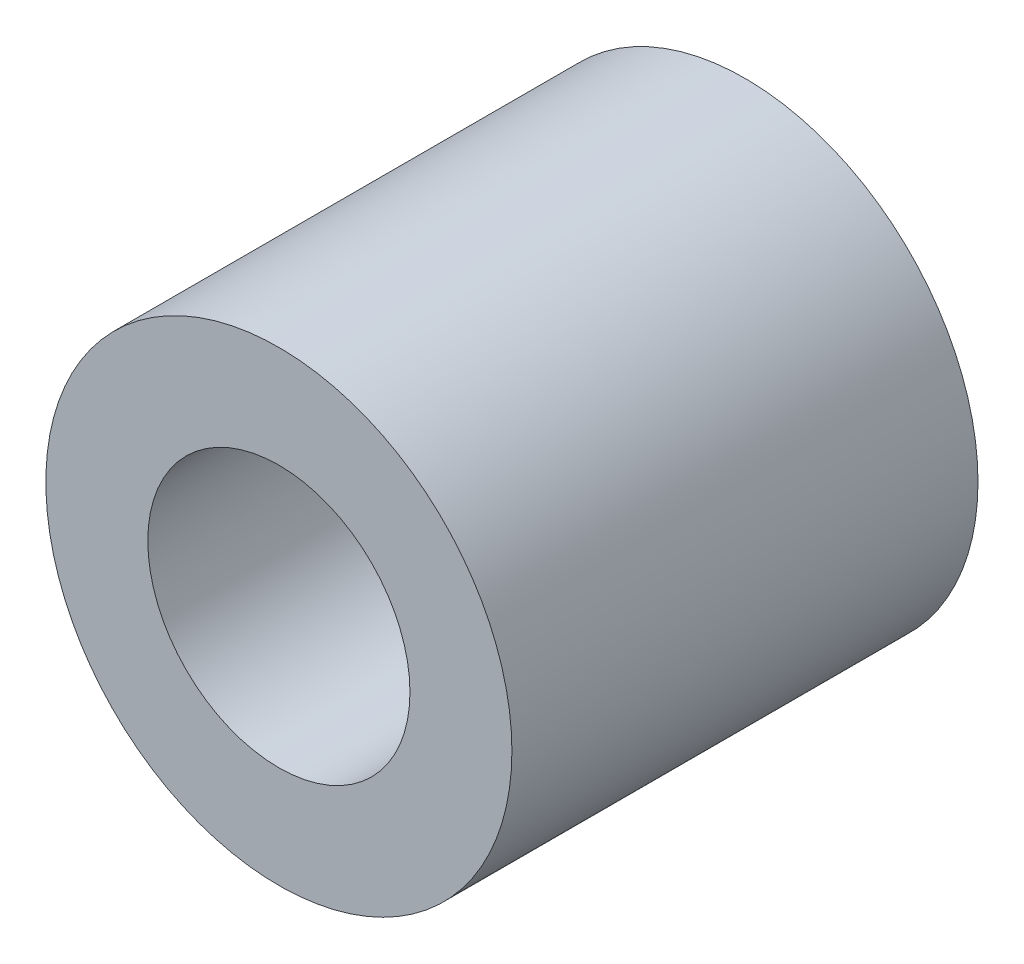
ISO-10303-21;
HEADER;
FILE_DESCRIPTION(('STEP AP214'),'2;1');
FILE_NAME('part.step','',(''),(''),'','','');
FILE_SCHEMA(('AUTOMOTIVE_DESIGN { 1 0 10303 214 1 1 1 1 }'));
ENDSEC;
DATA;
#1=APPLICATION_CONTEXT('core data for automotive mechanical design processes');
#2=APPLICATION_PROTOCOL_DEFINITION('international standard','automotive_design',2000,#1);
#3=PRODUCT_CONTEXT('',#1,'mechanical');
#4=PRODUCT('Part','Part','',(#3));
#5=PRODUCT_RELATED_PRODUCT_CATEGORY('part','',(#4));
#6=PRODUCT_DEFINITION_FORMATION('','',#4);
#7=PRODUCT_DEFINITION_CONTEXT('part definition',#1,'design');
#8=PRODUCT_DEFINITION('design','',#6,#7);
#9=PRODUCT_DEFINITION_SHAPE('','',#8);
#10=(LENGTH_UNIT() NAMED_UNIT(*) SI_UNIT(.MILLI.,.METRE.));
#11=(NAMED_UNIT(*) PLANE_ANGLE_UNIT() SI_UNIT($,.RADIAN.));
#12=(NAMED_UNIT(*) SI_UNIT($,.STERADIAN.) SOLID_ANGLE_UNIT());
#13=UNCERTAINTY_MEASURE_WITH_UNIT(LENGTH_MEASURE(1.E-05),#10,'distance_accuracy_value','');
#14=(GEOMETRIC_REPRESENTATION_CONTEXT(3) GLOBAL_UNCERTAINTY_ASSIGNED_CONTEXT((#13)) GLOBAL_UNIT_ASSIGNED_CONTEXT((#10,
#11,#12)) REPRESENTATION_CONTEXT('',''));
#15=CARTESIAN_POINT('',(0.,0.,0.));
#16=DIRECTION('',(0.,0.,1.));
#17=DIRECTION('',(1.,0.,0.));
#18=AXIS2_PLACEMENT_3D('',#15,#16,#17);
#19=CARTESIAN_POINT('',(9.,0.,9.));
#20=DIRECTION('',(0.,0.,-1.));
#21=DIRECTION('',(-1.,0.,0.));
#22=AXIS2_PLACEMENT_3D('',#19,#20,#21);
#23=PLANE('',#22);
#24=CARTESIAN_POINT('',(0.,0.,9.));
#25=DIRECTION('',(0.,0.,1.));
#26=DIRECTION('',(1.,0.,0.));
#27=AXIS2_PLACEMENT_3D('',#24,#25,#26);
#28=CIRCLE('',#27,5.5);
#29=CARTESIAN_POINT('',(5.5,0.,9.));
#30=VERTEX_POINT('',#29);
#31=EDGE_CURVE('E8',#30,#30,#28,.T.);
#32=ORIENTED_EDGE('',*,*,#31,.F.);
#33=EDGE_LOOP('',(#32));
#34=FACE_BOUND('',#33,.T.);
#35=CARTESIAN_POINT('',(0.,0.,9.));
#36=DIRECTION('',(0.,0.,1.));
#37=DIRECTION('',(1.,0.,0.));
#38=AXIS2_PLACEMENT_3D('',#35,#36,#37);
#39=CIRCLE('',#38,9.);
#40=CARTESIAN_POINT('',(9.,0.,9.));
#41=VERTEX_POINT('',#40);
#42=EDGE_CURVE('E34',#41,#41,#39,.T.);
#43=ORIENTED_EDGE('',*,*,#42,.T.);
#44=EDGE_LOOP('',(#43));
#45=FACE_BOUND('',#44,.T.);
#46=ADVANCED_FACE('F12',(#34,#45),#23,.F.);
#47=CARTESIAN_POINT('',(0.,0.,40.));
#48=DIRECTION('',(0.,0.,1.));
#49=DIRECTION('',(1.,0.,0.));
#50=AXIS2_PLACEMENT_3D('',#47,#48,#49);
#51=CYLINDRICAL_SURFACE('',#50,5.5);
#52=CARTESIAN_POINT('',(0.,0.,0.));
#53=DIRECTION('',(0.,0.,1.));
#54=DIRECTION('',(1.,0.,0.));
#55=AXIS2_PLACEMENT_3D('',#52,#53,#54);
#56=CIRCLE('',#55,5.5);
#57=CARTESIAN_POINT('',(5.5,0.,0.));
#58=VERTEX_POINT('',#57);
#59=EDGE_CURVE('E18',#58,#58,#56,.T.);
#60=ORIENTED_EDGE('',*,*,#59,.F.);
#61=EDGE_LOOP('',(#60));
#62=FACE_BOUND('',#61,.T.);
#63=ORIENTED_EDGE('',*,*,#31,.T.);
#64=EDGE_LOOP('',(#63));
#65=FACE_BOUND('',#64,.T.);
#66=ADVANCED_FACE('F59',(#62,#65),#51,.F.);
#67=CARTESIAN_POINT('',(5.5,0.,0.));
#68=DIRECTION('',(0.,0.,1.));
#69=DIRECTION('',(1.,0.,0.));
#70=AXIS2_PLACEMENT_3D('',#67,#68,#69);
#71=PLANE('',#70);
#72=CARTESIAN_POINT('',(0.,0.,0.));
#73=DIRECTION('',(0.,0.,1.));
#74=DIRECTION('',(1.,0.,0.));
#75=AXIS2_PLACEMENT_3D('',#72,#73,#74);
#76=CIRCLE('',#75,16.);
#77=CARTESIAN_POINT('',(16.,0.,0.));
#78=VERTEX_POINT('',#77);
#79=EDGE_CURVE('E22',#78,#78,#76,.T.);
#80=ORIENTED_EDGE('',*,*,#79,.F.);
#81=EDGE_LOOP('',(#80));
#82=FACE_BOUND('',#81,.T.);
#83=ORIENTED_EDGE('',*,*,#59,.T.);
#84=EDGE_LOOP('',(#83));
#85=FACE_BOUND('',#84,.T.);
#86=ADVANCED_FACE('F54',(#82,#85),#71,.F.);
#87=CARTESIAN_POINT('',(0.,0.,40.));
#88=DIRECTION('',(0.,0.,1.));
#89=DIRECTION('',(1.,0.,0.));
#90=AXIS2_PLACEMENT_3D('',#87,#88,#89);
#91=CYLINDRICAL_SURFACE('',#90,16.);
#92=CARTESIAN_POINT('',(0.,0.,32.));
#93=DIRECTION('',(0.,0.,1.));
#94=DIRECTION('',(1.,0.,0.));
#95=AXIS2_PLACEMENT_3D('',#92,#93,#94);
#96=CIRCLE('',#95,16.);
#97=CARTESIAN_POINT('',(16.,0.,32.));
#98=VERTEX_POINT('',#97);
#99=EDGE_CURVE('E26',#98,#98,#96,.T.);
#100=ORIENTED_EDGE('',*,*,#99,.F.);
#101=EDGE_LOOP('',(#100));
#102=FACE_BOUND('',#101,.T.);
#103=ORIENTED_EDGE('',*,*,#79,.T.);
#104=EDGE_LOOP('',(#103));
#105=FACE_BOUND('',#104,.T.);
#106=ADVANCED_FACE('F48',(#102,#105),#91,.T.);
#107=CARTESIAN_POINT('',(16.,0.,32.));
#108=DIRECTION('',(0.,0.,-1.));
#109=DIRECTION('',(-1.,0.,0.));
#110=AXIS2_PLACEMENT_3D('',#107,#108,#109);
#111=PLANE('',#110);
#112=CARTESIAN_POINT('',(0.,0.,32.));
#113=DIRECTION('',(0.,0.,1.));
#114=DIRECTION('',(1.,0.,0.));
#115=AXIS2_PLACEMENT_3D('',#112,#113,#114);
#116=CIRCLE('',#115,9.);
#117=CARTESIAN_POINT('',(9.,0.,32.));
#118=VERTEX_POINT('',#117);
#119=EDGE_CURVE('E31',#118,#118,#116,.T.);
#120=ORIENTED_EDGE('',*,*,#119,.F.);
#121=EDGE_LOOP('',(#120));
#122=FACE_BOUND('',#121,.T.);
#123=ORIENTED_EDGE('',*,*,#99,.T.);
#124=EDGE_LOOP('',(#123));
#125=FACE_BOUND('',#124,.T.);
#126=ADVANCED_FACE('F42',(#122,#125),#111,.F.);
#127=CARTESIAN_POINT('',(0.,0.,40.));
#128=DIRECTION('',(0.,0.,1.));
#129=DIRECTION('',(1.,0.,0.));
#130=AXIS2_PLACEMENT_3D('',#127,#128,#129);
#131=CYLINDRICAL_SURFACE('',#130,9.);
#132=ORIENTED_EDGE('',*,*,#42,.F.);
#133=EDGE_LOOP('',(#132));
#134=FACE_BOUND('',#133,.T.);
#135=ORIENTED_EDGE('',*,*,#119,.T.);
#136=EDGE_LOOP('',(#135));
#137=FACE_BOUND('',#136,.T.);
#138=ADVANCED_FACE('F39',(#134,#137),#131,.F.);
#139=CLOSED_SHELL('',(#46,#66,#86,#106,#126,#138));
#140=MANIFOLD_SOLID_BREP('B1',#139);
#141=ADVANCED_BREP_SHAPE_REPRESENTATION('',(#18,#140),#14);
#142=SHAPE_DEFINITION_REPRESENTATION(#9,#141);
ENDSEC;
END-ISO-10303-21;
